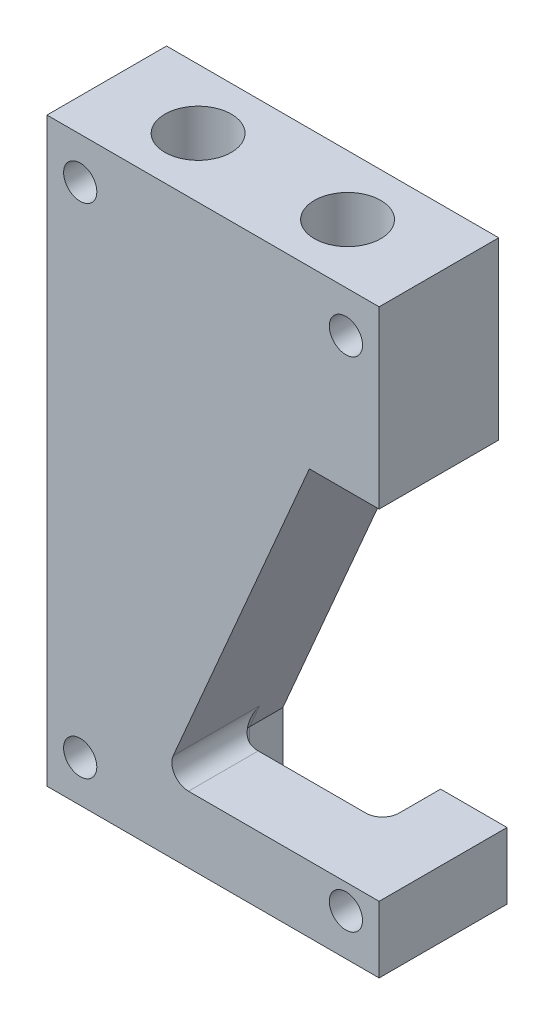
ISO-10303-21;
HEADER;
FILE_DESCRIPTION(('STEP AP214'),'2;1');
FILE_NAME('part.step','',(''),(''),'','','');
FILE_SCHEMA(('AUTOMOTIVE_DESIGN { 1 0 10303 214 1 1 1 1 }'));
ENDSEC;
DATA;
#1=APPLICATION_CONTEXT('core data for automotive mechanical design processes');
#2=APPLICATION_PROTOCOL_DEFINITION('international standard','automotive_design',2000,#1);
#3=PRODUCT_CONTEXT('',#1,'mechanical');
#4=PRODUCT('Part','Part','',(#3));
#5=PRODUCT_RELATED_PRODUCT_CATEGORY('part','',(#4));
#6=PRODUCT_DEFINITION_FORMATION('','',#4);
#7=PRODUCT_DEFINITION_CONTEXT('part definition',#1,'design');
#8=PRODUCT_DEFINITION('design','',#6,#7);
#9=PRODUCT_DEFINITION_SHAPE('','',#8);
#10=(LENGTH_UNIT() NAMED_UNIT(*) SI_UNIT(.MILLI.,.METRE.));
#11=(NAMED_UNIT(*) PLANE_ANGLE_UNIT() SI_UNIT($,.RADIAN.));
#12=(NAMED_UNIT(*) SI_UNIT($,.STERADIAN.) SOLID_ANGLE_UNIT());
#13=UNCERTAINTY_MEASURE_WITH_UNIT(LENGTH_MEASURE(1.E-05),#10,'distance_accuracy_value','');
#14=(GEOMETRIC_REPRESENTATION_CONTEXT(3) GLOBAL_UNCERTAINTY_ASSIGNED_CONTEXT((#13)) GLOBAL_UNIT_ASSIGNED_CONTEXT((#10,
#11,#12)) REPRESENTATION_CONTEXT('',''));
#15=CARTESIAN_POINT('',(0.,0.,0.));
#16=DIRECTION('',(0.,0.,1.));
#17=DIRECTION('',(1.,0.,0.));
#18=AXIS2_PLACEMENT_3D('',#15,#16,#17);
#19=CARTESIAN_POINT('',(10.,4.,-0.600000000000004));
#20=DIRECTION('',(0.,0.,1.));
#21=DIRECTION('',(1.,0.,0.));
#22=AXIS2_PLACEMENT_3D('',#19,#20,#21);
#23=PLANE('',#22);
#24=DIRECTION('',(-1.,0.,0.));
#25=VECTOR('',#24,1.);
#26=CARTESIAN_POINT('',(10.,4.,-0.600000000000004));
#27=LINE('',#26,#25);
#28=CARTESIAN_POINT('',(5.,4.,-0.600000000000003));
#29=VERTEX_POINT('',#28);
#30=CARTESIAN_POINT('',(-1.48102543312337,4.,-0.600000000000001));
#31=VERTEX_POINT('',#30);
#32=EDGE_CURVE('E207',#29,#31,#27,.T.);
#33=ORIENTED_EDGE('',*,*,#32,.F.);
#34=DIRECTION('',(0.,1.,0.));
#35=VECTOR('',#34,1.);
#36=CARTESIAN_POINT('',(5.,0.,-0.600000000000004));
#37=LINE('',#36,#35);
#38=CARTESIAN_POINT('',(5.,0.,-0.600000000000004));
#39=VERTEX_POINT('',#38);
#40=EDGE_CURVE('E61',#29,#39,#37,.F.);
#41=ORIENTED_EDGE('',*,*,#40,.T.);
#42=DIRECTION('',(-1.,0.,0.));
#43=VECTOR('',#42,1.);
#44=CARTESIAN_POINT('',(10.,0.,-0.600000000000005));
#45=LINE('',#44,#43);
#46=CARTESIAN_POINT('',(-2.,0.,-0.600000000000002));
#47=VERTEX_POINT('',#46);
#48=EDGE_CURVE('E210',#39,#47,#45,.T.);
#49=ORIENTED_EDGE('',*,*,#48,.T.);
#50=DIRECTION('',(0.,1.,0.));
#51=VECTOR('',#50,1.);
#52=CARTESIAN_POINT('',(-2.,4.,-0.600000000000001));
#53=LINE('',#52,#51);
#54=CARTESIAN_POINT('',(-2.,3.79397387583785,-0.600000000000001));
#55=VERTEX_POINT('',#54);
#56=EDGE_CURVE('E344',#47,#55,#53,.T.);
#57=ORIENTED_EDGE('',*,*,#56,.T.);
#58=DIRECTION('',(-0.395274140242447,-0.918563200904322,0.));
#59=VECTOR('',#58,1.);
#60=CARTESIAN_POINT('',(-1.48102543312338,5.,-0.600000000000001));
#61=LINE('',#60,#59);
#62=CARTESIAN_POINT('',(-1.87629957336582,4.08143679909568,-0.600000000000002));
#63=VERTEX_POINT('',#62);
#64=EDGE_CURVE('E347',#55,#63,#61,.F.);
#65=ORIENTED_EDGE('',*,*,#64,.T.);
#66=CARTESIAN_POINT('',(-1.48102543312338,5.,-0.600000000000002));
#67=DIRECTION('',(0.,0.,1.));
#68=DIRECTION('',(1.,0.,0.));
#69=AXIS2_PLACEMENT_3D('',#66,#67,#68);
#70=CIRCLE('',#69,1.);
#71=EDGE_CURVE('E336',#63,#31,#70,.T.);
#72=ORIENTED_EDGE('',*,*,#71,.T.);
#73=EDGE_LOOP('',(#33,#41,#49,#57,#65,#72));
#74=FACE_BOUND('',#73,.T.);
#75=ADVANCED_FACE('F45',(#74),#23,.F.);
#76=CARTESIAN_POINT('',(-3.,0.,-3.6));
#77=DIRECTION('',(-1.,0.,0.));
#78=DIRECTION('',(0.,0.,1.));
#79=AXIS2_PLACEMENT_3D('',#76,#77,#78);
#80=PLANE('',#79);
#81=DIRECTION('',(0.,0.,1.));
#82=VECTOR('',#81,1.);
#83=CARTESIAN_POINT('',(-3.,4.,-3.6));
#84=LINE('',#83,#82);
#85=CARTESIAN_POINT('',(-3.,4.,-3.6));
#86=VERTEX_POINT('',#85);
#87=CARTESIAN_POINT('',(-3.,4.,-1.6));
#88=VERTEX_POINT('',#87);
#89=EDGE_CURVE('E242',#86,#88,#84,.T.);
#90=ORIENTED_EDGE('',*,*,#89,.T.);
#91=DIRECTION('',(0.,1.,0.));
#92=VECTOR('',#91,1.);
#93=CARTESIAN_POINT('',(-3.,0.,-1.6));
#94=LINE('',#93,#92);
#95=CARTESIAN_POINT('',(-3.,0.,-1.6));
#96=VERTEX_POINT('',#95);
#97=EDGE_CURVE('E350',#88,#96,#94,.F.);
#98=ORIENTED_EDGE('',*,*,#97,.T.);
#99=DIRECTION('',(0.,0.,1.));
#100=VECTOR('',#99,1.);
#101=CARTESIAN_POINT('',(-3.,0.,-3.6));
#102=LINE('',#101,#100);
#103=CARTESIAN_POINT('',(-3.,0.,-3.6));
#104=VERTEX_POINT('',#103);
#105=EDGE_CURVE('E238',#104,#96,#102,.T.);
#106=ORIENTED_EDGE('',*,*,#105,.F.);
#107=DIRECTION('',(0.,-1.,0.));
#108=VECTOR('',#107,1.);
#109=CARTESIAN_POINT('',(-3.,0.,-3.6));
#110=LINE('',#109,#108);
#111=EDGE_CURVE('E223',#86,#104,#110,.T.);
#112=ORIENTED_EDGE('',*,*,#111,.F.);
#113=EDGE_LOOP('',(#90,#98,#106,#112));
#114=FACE_BOUND('',#113,.T.);
#115=ADVANCED_FACE('F395',(#114),#80,.F.);
#116=CARTESIAN_POINT('',(-10.,35.,-3.6));
#117=DIRECTION('',(1.,0.,0.));
#118=DIRECTION('',(0.,0.,-1.));
#119=AXIS2_PLACEMENT_3D('',#116,#117,#118);
#120=PLANE('',#119);
#121=DIRECTION('',(0.,0.,1.));
#122=VECTOR('',#121,1.);
#123=CARTESIAN_POINT('',(-10.,0.,-3.6));
#124=LINE('',#123,#122);
#125=CARTESIAN_POINT('',(-10.,0.,-3.6));
#126=VERTEX_POINT('',#125);
#127=CARTESIAN_POINT('',(-10.,0.,3.6));
#128=VERTEX_POINT('',#127);
#129=EDGE_CURVE('E276',#126,#128,#124,.T.);
#130=ORIENTED_EDGE('',*,*,#129,.T.);
#131=DIRECTION('',(0.,-1.,0.));
#132=VECTOR('',#131,1.);
#133=CARTESIAN_POINT('',(-10.,35.,3.6));
#134=LINE('',#133,#132);
#135=CARTESIAN_POINT('',(-10.,35.,3.6));
#136=VERTEX_POINT('',#135);
#137=EDGE_CURVE('E322',#136,#128,#134,.T.);
#138=ORIENTED_EDGE('',*,*,#137,.F.);
#139=DIRECTION('',(0.,0.,1.));
#140=VECTOR('',#139,1.);
#141=CARTESIAN_POINT('',(-10.,35.,-3.6));
#142=LINE('',#141,#140);
#143=CARTESIAN_POINT('',(-10.,35.,-3.6));
#144=VERTEX_POINT('',#143);
#145=EDGE_CURVE('E288',#144,#136,#142,.T.);
#146=ORIENTED_EDGE('',*,*,#145,.F.);
#147=DIRECTION('',(0.,-1.,0.));
#148=VECTOR('',#147,1.);
#149=CARTESIAN_POINT('',(-10.,35.,-3.6));
#150=LINE('',#149,#148);
#151=EDGE_CURVE('E302',#144,#126,#150,.T.);
#152=ORIENTED_EDGE('',*,*,#151,.T.);
#153=EDGE_LOOP('',(#130,#138,#146,#152));
#154=FACE_BOUND('',#153,.T.);
#155=ADVANCED_FACE('F385',(#154),#120,.F.);
#156=CARTESIAN_POINT('',(-10.,35.,3.6));
#157=DIRECTION('',(0.,0.,-1.));
#158=DIRECTION('',(-1.,0.,0.));
#159=AXIS2_PLACEMENT_3D('',#156,#157,#158);
#160=PLANE('',#159);
#161=CARTESIAN_POINT('',(8.,2.5,3.6));
#162=DIRECTION('',(0.,0.,1.));
#163=DIRECTION('',(1.,0.,0.));
#164=AXIS2_PLACEMENT_3D('',#161,#162,#163);
#165=CIRCLE('',#164,1.);
#166=CARTESIAN_POINT('',(9.,2.5,3.6));
#167=VERTEX_POINT('',#166);
#168=EDGE_CURVE('E186',#167,#167,#165,.T.);
#169=ORIENTED_EDGE('',*,*,#168,.F.);
#170=EDGE_LOOP('',(#169));
#171=FACE_BOUND('',#170,.T.);
#172=CARTESIAN_POINT('',(8.,32.5,3.6));
#173=DIRECTION('',(0.,0.,1.));
#174=DIRECTION('',(1.,0.,0.));
#175=AXIS2_PLACEMENT_3D('',#172,#173,#174);
#176=CIRCLE('',#175,1.);
#177=CARTESIAN_POINT('',(9.,32.5,3.6));
#178=VERTEX_POINT('',#177);
#179=EDGE_CURVE('E248',#178,#178,#176,.T.);
#180=ORIENTED_EDGE('',*,*,#179,.F.);
#181=EDGE_LOOP('',(#180));
#182=FACE_BOUND('',#181,.T.);
#183=CARTESIAN_POINT('',(-8.,2.5,3.6));
#184=DIRECTION('',(0.,0.,1.));
#185=DIRECTION('',(1.,0.,0.));
#186=AXIS2_PLACEMENT_3D('',#183,#184,#185);
#187=CIRCLE('',#186,1.);
#188=CARTESIAN_POINT('',(-7.,2.5,3.6));
#189=VERTEX_POINT('',#188);
#190=EDGE_CURVE('E257',#189,#189,#187,.T.);
#191=ORIENTED_EDGE('',*,*,#190,.F.);
#192=EDGE_LOOP('',(#191));
#193=FACE_BOUND('',#192,.T.);
#194=CARTESIAN_POINT('',(-8.,32.5,3.6));
#195=DIRECTION('',(0.,0.,1.));
#196=DIRECTION('',(1.,0.,0.));
#197=AXIS2_PLACEMENT_3D('',#194,#195,#196);
#198=CIRCLE('',#197,1.);
#199=CARTESIAN_POINT('',(-7.,32.5,3.6));
#200=VERTEX_POINT('',#199);
#201=EDGE_CURVE('E252',#200,#200,#198,.T.);
#202=ORIENTED_EDGE('',*,*,#201,.F.);
#203=EDGE_LOOP('',(#202));
#204=FACE_BOUND('',#203,.T.);
#205=DIRECTION('',(-0.395274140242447,-0.918563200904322,0.));
#206=VECTOR('',#205,1.);
#207=CARTESIAN_POINT('',(-3.,4.,3.6));
#208=LINE('',#207,#206);
#209=CARTESIAN_POINT('',(5.8,24.45,3.6));
#210=VERTEX_POINT('',#209);
#211=CARTESIAN_POINT('',(-2.3995886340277,5.39527414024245,3.6));
#212=VERTEX_POINT('',#211);
#213=EDGE_CURVE('E219',#210,#212,#208,.T.);
#214=ORIENTED_EDGE('',*,*,#213,.F.);
#215=DIRECTION('',(-1.,0.,0.));
#216=VECTOR('',#215,1.);
#217=CARTESIAN_POINT('',(5.8,24.45,3.6));
#218=LINE('',#217,#216);
#219=CARTESIAN_POINT('',(10.,24.45,3.6));
#220=VERTEX_POINT('',#219);
#221=EDGE_CURVE('E213',#220,#210,#218,.T.);
#222=ORIENTED_EDGE('',*,*,#221,.F.);
#223=DIRECTION('',(0.,-1.,0.));
#224=VECTOR('',#223,1.);
#225=CARTESIAN_POINT('',(10.,35.,3.6));
#226=LINE('',#225,#224);
#227=CARTESIAN_POINT('',(10.,35.,3.6));
#228=VERTEX_POINT('',#227);
#229=EDGE_CURVE('E318',#228,#220,#226,.T.);
#230=ORIENTED_EDGE('',*,*,#229,.F.);
#231=DIRECTION('',(1.,0.,0.));
#232=VECTOR('',#231,1.);
#233=CARTESIAN_POINT('',(-10.,35.,3.6));
#234=LINE('',#233,#232);
#235=EDGE_CURVE('E292',#136,#228,#234,.T.);
#236=ORIENTED_EDGE('',*,*,#235,.F.);
#237=ORIENTED_EDGE('',*,*,#137,.T.);
#238=DIRECTION('',(1.,0.,0.));
#239=VECTOR('',#238,1.);
#240=CARTESIAN_POINT('',(-10.,0.,3.6));
#241=LINE('',#240,#239);
#242=CARTESIAN_POINT('',(10.,0.,3.6));
#243=VERTEX_POINT('',#242);
#244=EDGE_CURVE('E306',#128,#243,#241,.T.);
#245=ORIENTED_EDGE('',*,*,#244,.T.);
#246=DIRECTION('',(0.,-1.,0.));
#247=VECTOR('',#246,1.);
#248=CARTESIAN_POINT('',(10.,4.,3.6));
#249=LINE('',#248,#247);
#250=CARTESIAN_POINT('',(10.,4.,3.6));
#251=VERTEX_POINT('',#250);
#252=EDGE_CURVE('E161',#251,#243,#249,.T.);
#253=ORIENTED_EDGE('',*,*,#252,.F.);
#254=DIRECTION('',(-1.,0.,0.));
#255=VECTOR('',#254,1.);
#256=CARTESIAN_POINT('',(10.,4.,3.6));
#257=LINE('',#256,#255);
#258=CARTESIAN_POINT('',(-1.48102543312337,4.,3.6));
#259=VERTEX_POINT('',#258);
#260=EDGE_CURVE('E203',#251,#259,#257,.T.);
#261=ORIENTED_EDGE('',*,*,#260,.T.);
#262=CARTESIAN_POINT('',(-1.48102543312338,5.,3.6));
#263=DIRECTION('',(0.,0.,-1.));
#264=DIRECTION('',(-1.,0.,0.));
#265=AXIS2_PLACEMENT_3D('',#262,#263,#264);
#266=CIRCLE('',#265,1.);
#267=EDGE_CURVE('E333',#259,#212,#266,.T.);
#268=ORIENTED_EDGE('',*,*,#267,.T.);
#269=EDGE_LOOP('',(#214,#222,#230,#236,#237,#245,#253,#261,#268));
#270=FACE_BOUND('',#269,.T.);
#271=ADVANCED_FACE('F381',(#171,#182,#193,#204,#270),#160,.F.);
#272=CARTESIAN_POINT('',(10.,35.,-3.6));
#273=DIRECTION('',(-1.,0.,0.));
#274=DIRECTION('',(0.,0.,1.));
#275=AXIS2_PLACEMENT_3D('',#272,#273,#274);
#276=PLANE('',#275);
#277=ORIENTED_EDGE('',*,*,#229,.T.);
#278=DIRECTION('',(0.,0.,1.));
#279=VECTOR('',#278,1.);
#280=CARTESIAN_POINT('',(10.,24.45,-3.6));
#281=LINE('',#280,#279);
#282=CARTESIAN_POINT('',(10.,24.45,-3.6));
#283=VERTEX_POINT('',#282);
#284=EDGE_CURVE('E234',#283,#220,#281,.T.);
#285=ORIENTED_EDGE('',*,*,#284,.F.);
#286=DIRECTION('',(0.,-1.,0.));
#287=VECTOR('',#286,1.);
#288=CARTESIAN_POINT('',(10.,35.,-3.6));
#289=LINE('',#288,#287);
#290=CARTESIAN_POINT('',(10.,35.,-3.6));
#291=VERTEX_POINT('',#290);
#292=EDGE_CURVE('E314',#291,#283,#289,.T.);
#293=ORIENTED_EDGE('',*,*,#292,.F.);
#294=DIRECTION('',(0.,0.,-1.));
#295=VECTOR('',#294,1.);
#296=CARTESIAN_POINT('',(10.,35.,-3.6));
#297=LINE('',#296,#295);
#298=EDGE_CURVE('E296',#228,#291,#297,.T.);
#299=ORIENTED_EDGE('',*,*,#298,.F.);
#300=EDGE_LOOP('',(#277,#285,#293,#299));
#301=FACE_BOUND('',#300,.T.);
#302=ADVANCED_FACE('F470',(#301),#276,.F.);
#303=CARTESIAN_POINT('',(-10.,35.,-3.6));
#304=DIRECTION('',(0.,0.,1.));
#305=DIRECTION('',(1.,0.,0.));
#306=AXIS2_PLACEMENT_3D('',#303,#304,#305);
#307=PLANE('',#306);
#308=ORIENTED_EDGE('',*,*,#292,.T.);
#309=DIRECTION('',(-1.,0.,0.));
#310=VECTOR('',#309,1.);
#311=CARTESIAN_POINT('',(5.8,24.45,-3.6));
#312=LINE('',#311,#310);
#313=CARTESIAN_POINT('',(5.8,24.45,-3.6));
#314=VERTEX_POINT('',#313);
#315=EDGE_CURVE('E214',#283,#314,#312,.T.);
#316=ORIENTED_EDGE('',*,*,#315,.T.);
#317=DIRECTION('',(-0.395274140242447,-0.918563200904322,0.));
#318=VECTOR('',#317,1.);
#319=CARTESIAN_POINT('',(-3.,4.,-3.6));
#320=LINE('',#319,#318);
#321=EDGE_CURVE('E218',#314,#86,#320,.T.);
#322=ORIENTED_EDGE('',*,*,#321,.T.);
#323=ORIENTED_EDGE('',*,*,#111,.T.);
#324=DIRECTION('',(-1.,0.,0.));
#325=VECTOR('',#324,1.);
#326=CARTESIAN_POINT('',(-10.,0.,-3.6));
#327=LINE('',#326,#325);
#328=EDGE_CURVE('E293',#104,#126,#327,.T.);
#329=ORIENTED_EDGE('',*,*,#328,.T.);
#330=ORIENTED_EDGE('',*,*,#151,.F.);
#331=DIRECTION('',(-1.,0.,0.));
#332=VECTOR('',#331,1.);
#333=CARTESIAN_POINT('',(-10.,35.,-3.6));
#334=LINE('',#333,#332);
#335=EDGE_CURVE('E299',#291,#144,#334,.T.);
#336=ORIENTED_EDGE('',*,*,#335,.F.);
#337=EDGE_LOOP('',(#308,#316,#322,#323,#329,#330,#336));
#338=FACE_BOUND('',#337,.T.);
#339=CARTESIAN_POINT('',(8.,32.5,-3.6));
#340=DIRECTION('',(0.,0.,1.));
#341=DIRECTION('',(1.,0.,0.));
#342=AXIS2_PLACEMENT_3D('',#339,#340,#341);
#343=CIRCLE('',#342,1.);
#344=CARTESIAN_POINT('',(9.,32.5,-3.6));
#345=VERTEX_POINT('',#344);
#346=EDGE_CURVE('E253',#345,#345,#343,.T.);
#347=ORIENTED_EDGE('',*,*,#346,.T.);
#348=EDGE_LOOP('',(#347));
#349=FACE_BOUND('',#348,.T.);
#350=CARTESIAN_POINT('',(-8.,2.5,-3.6));
#351=DIRECTION('',(0.,0.,1.));
#352=DIRECTION('',(1.,0.,0.));
#353=AXIS2_PLACEMENT_3D('',#350,#351,#352);
#354=CIRCLE('',#353,1.);
#355=CARTESIAN_POINT('',(-7.,2.5,-3.6));
#356=VERTEX_POINT('',#355);
#357=EDGE_CURVE('E237',#356,#356,#354,.T.);
#358=ORIENTED_EDGE('',*,*,#357,.T.);
#359=EDGE_LOOP('',(#358));
#360=FACE_BOUND('',#359,.T.);
#361=CARTESIAN_POINT('',(-8.,32.5,-3.6));
#362=DIRECTION('',(0.,0.,1.));
#363=DIRECTION('',(1.,0.,0.));
#364=AXIS2_PLACEMENT_3D('',#361,#362,#363);
#365=CIRCLE('',#364,1.);
#366=CARTESIAN_POINT('',(-7.,32.5,-3.6));
#367=VERTEX_POINT('',#366);
#368=EDGE_CURVE('E264',#367,#367,#365,.T.);
#369=ORIENTED_EDGE('',*,*,#368,.T.);
#370=EDGE_LOOP('',(#369));
#371=FACE_BOUND('',#370,.T.);
#372=ADVANCED_FACE('F390',(#338,#349,#360,#371),#307,.F.);
#373=CARTESIAN_POINT('',(0.,35.,0.));
#374=DIRECTION('',(0.,1.,0.));
#375=DIRECTION('',(0.,0.,1.));
#376=AXIS2_PLACEMENT_3D('',#373,#374,#375);
#377=PLANE('',#376);
#378=CARTESIAN_POINT('',(-4.5,35.,0.));
#379=DIRECTION('',(0.,1.,0.));
#380=DIRECTION('',(0.,0.,1.));
#381=AXIS2_PLACEMENT_3D('',#378,#379,#380);
#382=CIRCLE('',#381,2.);
#383=CARTESIAN_POINT('',(-4.5,35.,2.));
#384=VERTEX_POINT('',#383);
#385=EDGE_CURVE('E277',#384,#384,#382,.T.);
#386=ORIENTED_EDGE('',*,*,#385,.F.);
#387=EDGE_LOOP('',(#386));
#388=FACE_BOUND('',#387,.T.);
#389=CARTESIAN_POINT('',(4.5,35.,0.));
#390=DIRECTION('',(0.,1.,0.));
#391=DIRECTION('',(0.,0.,1.));
#392=AXIS2_PLACEMENT_3D('',#389,#390,#391);
#393=CIRCLE('',#392,2.);
#394=CARTESIAN_POINT('',(4.5,35.,2.));
#395=VERTEX_POINT('',#394);
#396=EDGE_CURVE('E281',#395,#395,#393,.T.);
#397=ORIENTED_EDGE('',*,*,#396,.F.);
#398=EDGE_LOOP('',(#397));
#399=FACE_BOUND('',#398,.T.);
#400=ORIENTED_EDGE('',*,*,#145,.T.);
#401=ORIENTED_EDGE('',*,*,#235,.T.);
#402=ORIENTED_EDGE('',*,*,#298,.T.);
#403=ORIENTED_EDGE('',*,*,#335,.T.);
#404=EDGE_LOOP('',(#400,#401,#402,#403));
#405=FACE_BOUND('',#404,.T.);
#406=ADVANCED_FACE('F463',(#388,#399,#405),#377,.T.);
#407=CARTESIAN_POINT('',(0.,0.,0.));
#408=DIRECTION('',(0.,1.,0.));
#409=DIRECTION('',(0.,0.,1.));
#410=AXIS2_PLACEMENT_3D('',#407,#408,#409);
#411=PLANE('',#410);
#412=ORIENTED_EDGE('',*,*,#328,.F.);
#413=ORIENTED_EDGE('',*,*,#105,.T.);
#414=CARTESIAN_POINT('',(-2.,0.,-1.6));
#415=DIRECTION('',(0.,1.,0.));
#416=DIRECTION('',(0.,0.,1.));
#417=AXIS2_PLACEMENT_3D('',#414,#415,#416);
#418=CIRCLE('',#417,1.);
#419=EDGE_CURVE('E357',#96,#47,#418,.T.);
#420=ORIENTED_EDGE('',*,*,#419,.T.);
#421=ORIENTED_EDGE('',*,*,#48,.F.);
#422=CARTESIAN_POINT('',(5.,0.,-1.6));
#423=DIRECTION('',(0.,1.,0.));
#424=DIRECTION('',(0.,0.,1.));
#425=AXIS2_PLACEMENT_3D('',#422,#423,#424);
#426=CIRCLE('',#425,1.);
#427=CARTESIAN_POINT('',(6.,0.,-1.6));
#428=VERTEX_POINT('',#427);
#429=EDGE_CURVE('E11',#39,#428,#426,.T.);
#430=ORIENTED_EDGE('',*,*,#429,.T.);
#431=DIRECTION('',(0.,0.,1.));
#432=VECTOR('',#431,1.);
#433=CARTESIAN_POINT('',(6.,0.,-4.1));
#434=LINE('',#433,#432);
#435=CARTESIAN_POINT('',(6.,0.,-4.1));
#436=VERTEX_POINT('',#435);
#437=EDGE_CURVE('E171',#436,#428,#434,.T.);
#438=ORIENTED_EDGE('',*,*,#437,.F.);
#439=DIRECTION('',(-1.,0.,0.));
#440=VECTOR('',#439,1.);
#441=CARTESIAN_POINT('',(10.,0.,-4.1));
#442=LINE('',#441,#440);
#443=CARTESIAN_POINT('',(10.,0.,-4.1));
#444=VERTEX_POINT('',#443);
#445=EDGE_CURVE('E167',#444,#436,#442,.T.);
#446=ORIENTED_EDGE('',*,*,#445,.F.);
#447=DIRECTION('',(0.,0.,-1.));
#448=VECTOR('',#447,1.);
#449=CARTESIAN_POINT('',(10.,0.,3.6));
#450=LINE('',#449,#448);
#451=EDGE_CURVE('E155',#243,#444,#450,.T.);
#452=ORIENTED_EDGE('',*,*,#451,.F.);
#453=ORIENTED_EDGE('',*,*,#244,.F.);
#454=ORIENTED_EDGE('',*,*,#129,.F.);
#455=EDGE_LOOP('',(#412,#413,#420,#421,#430,#438,#446,#452,#453,#454));
#456=FACE_BOUND('',#455,.T.);
#457=ADVANCED_FACE('F169',(#456),#411,.F.);
#458=CARTESIAN_POINT('',(4.5,28.,0.));
#459=DIRECTION('',(0.,1.,0.));
#460=DIRECTION('',(0.,0.,1.));
#461=AXIS2_PLACEMENT_3D('',#458,#459,#460);
#462=CYLINDRICAL_SURFACE('',#461,2.);
#463=CARTESIAN_POINT('',(4.5,28.,0.));
#464=DIRECTION('',(0.,1.,0.));
#465=DIRECTION('',(0.,0.,1.));
#466=AXIS2_PLACEMENT_3D('',#463,#464,#465);
#467=CIRCLE('',#466,2.);
#468=CARTESIAN_POINT('',(4.5,28.,2.));
#469=VERTEX_POINT('',#468);
#470=EDGE_CURVE('E268',#469,#469,#467,.T.);
#471=ORIENTED_EDGE('',*,*,#470,.F.);
#472=EDGE_LOOP('',(#471));
#473=FACE_BOUND('',#472,.T.);
#474=ORIENTED_EDGE('',*,*,#396,.T.);
#475=EDGE_LOOP('',(#474));
#476=FACE_BOUND('',#475,.T.);
#477=ADVANCED_FACE('F456',(#473,#476),#462,.F.);
#478=CARTESIAN_POINT('',(4.5,28.,0.));
#479=DIRECTION('',(0.,1.,0.));
#480=DIRECTION('',(0.,0.,1.));
#481=AXIS2_PLACEMENT_3D('',#478,#479,#480);
#482=PLANE('',#481);
#483=ORIENTED_EDGE('',*,*,#470,.T.);
#484=EDGE_LOOP('',(#483));
#485=FACE_BOUND('',#484,.T.);
#486=ADVANCED_FACE('F454',(#485),#482,.T.);
#487=CARTESIAN_POINT('',(-4.5,28.,0.));
#488=DIRECTION('',(0.,1.,0.));
#489=DIRECTION('',(0.,0.,1.));
#490=AXIS2_PLACEMENT_3D('',#487,#488,#489);
#491=CYLINDRICAL_SURFACE('',#490,2.);
#492=CARTESIAN_POINT('',(-4.5,28.,0.));
#493=DIRECTION('',(0.,1.,0.));
#494=DIRECTION('',(0.,0.,1.));
#495=AXIS2_PLACEMENT_3D('',#492,#493,#494);
#496=CIRCLE('',#495,2.);
#497=CARTESIAN_POINT('',(-4.5,28.,2.));
#498=VERTEX_POINT('',#497);
#499=EDGE_CURVE('E272',#498,#498,#496,.T.);
#500=ORIENTED_EDGE('',*,*,#499,.F.);
#501=EDGE_LOOP('',(#500));
#502=FACE_BOUND('',#501,.T.);
#503=ORIENTED_EDGE('',*,*,#385,.T.);
#504=EDGE_LOOP('',(#503));
#505=FACE_BOUND('',#504,.T.);
#506=ADVANCED_FACE('F450',(#502,#505),#491,.F.);
#507=CARTESIAN_POINT('',(-4.5,28.,0.));
#508=DIRECTION('',(0.,1.,0.));
#509=DIRECTION('',(0.,0.,1.));
#510=AXIS2_PLACEMENT_3D('',#507,#508,#509);
#511=PLANE('',#510);
#512=ORIENTED_EDGE('',*,*,#499,.T.);
#513=EDGE_LOOP('',(#512));
#514=FACE_BOUND('',#513,.T.);
#515=ADVANCED_FACE('F446',(#514),#511,.T.);
#516=CARTESIAN_POINT('',(-8.,32.5,-3.6));
#517=DIRECTION('',(0.,0.,1.));
#518=DIRECTION('',(1.,0.,0.));
#519=AXIS2_PLACEMENT_3D('',#516,#517,#518);
#520=CYLINDRICAL_SURFACE('',#519,1.);
#521=ORIENTED_EDGE('',*,*,#368,.F.);
#522=EDGE_LOOP('',(#521));
#523=FACE_BOUND('',#522,.T.);
#524=ORIENTED_EDGE('',*,*,#201,.T.);
#525=EDGE_LOOP('',(#524));
#526=FACE_BOUND('',#525,.T.);
#527=ADVANCED_FACE('F442',(#523,#526),#520,.F.);
#528=CARTESIAN_POINT('',(-8.,2.5,-3.6));
#529=DIRECTION('',(0.,0.,1.));
#530=DIRECTION('',(1.,0.,0.));
#531=AXIS2_PLACEMENT_3D('',#528,#529,#530);
#532=CYLINDRICAL_SURFACE('',#531,1.);
#533=ORIENTED_EDGE('',*,*,#357,.F.);
#534=EDGE_LOOP('',(#533));
#535=FACE_BOUND('',#534,.T.);
#536=ORIENTED_EDGE('',*,*,#190,.T.);
#537=EDGE_LOOP('',(#536));
#538=FACE_BOUND('',#537,.T.);
#539=ADVANCED_FACE('F438',(#535,#538),#532,.F.);
#540=CARTESIAN_POINT('',(8.,32.5,-3.6));
#541=DIRECTION('',(0.,0.,1.));
#542=DIRECTION('',(1.,0.,0.));
#543=AXIS2_PLACEMENT_3D('',#540,#541,#542);
#544=CYLINDRICAL_SURFACE('',#543,1.);
#545=ORIENTED_EDGE('',*,*,#346,.F.);
#546=EDGE_LOOP('',(#545));
#547=FACE_BOUND('',#546,.T.);
#548=ORIENTED_EDGE('',*,*,#179,.T.);
#549=EDGE_LOOP('',(#548));
#550=FACE_BOUND('',#549,.T.);
#551=ADVANCED_FACE('F434',(#547,#550),#544,.F.);
#552=CARTESIAN_POINT('',(5.8,24.45,-3.6));
#553=DIRECTION('',(0.,1.,0.));
#554=DIRECTION('',(0.,0.,1.));
#555=AXIS2_PLACEMENT_3D('',#552,#553,#554);
#556=PLANE('',#555);
#557=ORIENTED_EDGE('',*,*,#221,.T.);
#558=DIRECTION('',(0.,0.,1.));
#559=VECTOR('',#558,1.);
#560=CARTESIAN_POINT('',(5.8,24.45,-3.6));
#561=LINE('',#560,#559);
#562=EDGE_CURVE('E227',#314,#210,#561,.T.);
#563=ORIENTED_EDGE('',*,*,#562,.F.);
#564=ORIENTED_EDGE('',*,*,#315,.F.);
#565=ORIENTED_EDGE('',*,*,#284,.T.);
#566=EDGE_LOOP('',(#557,#563,#564,#565));
#567=FACE_BOUND('',#566,.T.);
#568=ADVANCED_FACE('F430',(#567),#556,.F.);
#569=CARTESIAN_POINT('',(-3.,4.,-3.6));
#570=DIRECTION('',(-0.918563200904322,0.395274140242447,0.));
#571=DIRECTION('',(-0.395274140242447,-0.918563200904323,0.));
#572=AXIS2_PLACEMENT_3D('',#569,#570,#571);
#573=PLANE('',#572);
#574=DIRECTION('',(0.,0.,1.));
#575=VECTOR('',#574,1.);
#576=CARTESIAN_POINT('',(-2.3995886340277,5.39527414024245,-0.600000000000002));
#577=LINE('',#576,#575);
#578=CARTESIAN_POINT('',(-2.3995886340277,5.39527414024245,-1.6));
#579=VERTEX_POINT('',#578);
#580=EDGE_CURVE('E330',#212,#579,#577,.F.);
#581=ORIENTED_EDGE('',*,*,#580,.T.);
#582=DIRECTION('',(-0.395274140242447,-0.918563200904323,0.));
#583=VECTOR('',#582,1.);
#584=CARTESIAN_POINT('',(-3.,4.,-1.6));
#585=LINE('',#584,#583);
#586=EDGE_CURVE('E340',#579,#88,#585,.T.);
#587=ORIENTED_EDGE('',*,*,#586,.T.);
#588=ORIENTED_EDGE('',*,*,#89,.F.);
#589=ORIENTED_EDGE('',*,*,#321,.F.);
#590=ORIENTED_EDGE('',*,*,#562,.T.);
#591=ORIENTED_EDGE('',*,*,#213,.T.);
#592=EDGE_LOOP('',(#581,#587,#588,#589,#590,#591));
#593=FACE_BOUND('',#592,.T.);
#594=ADVANCED_FACE('F427',(#593),#573,.F.);
#595=CARTESIAN_POINT('',(10.,4.,3.6));
#596=DIRECTION('',(0.,-1.,0.));
#597=DIRECTION('',(0.,0.,-1.));
#598=AXIS2_PLACEMENT_3D('',#595,#596,#597);
#599=PLANE('',#598);
#600=DIRECTION('',(0.,0.,1.));
#601=VECTOR('',#600,1.);
#602=CARTESIAN_POINT('',(6.,4.,-4.1));
#603=LINE('',#602,#601);
#604=CARTESIAN_POINT('',(6.,4.,-4.1));
#605=VERTEX_POINT('',#604);
#606=CARTESIAN_POINT('',(6.,4.,-1.6));
#607=VERTEX_POINT('',#606);
#608=EDGE_CURVE('E194',#605,#607,#603,.T.);
#609=ORIENTED_EDGE('',*,*,#608,.T.);
#610=CARTESIAN_POINT('',(5.,4.,-1.6));
#611=DIRECTION('',(0.,-1.,0.));
#612=DIRECTION('',(0.,0.,-1.));
#613=AXIS2_PLACEMENT_3D('',#610,#611,#612);
#614=CIRCLE('',#613,1.);
#615=EDGE_CURVE('E54',#607,#29,#614,.T.);
#616=ORIENTED_EDGE('',*,*,#615,.T.);
#617=ORIENTED_EDGE('',*,*,#32,.T.);
#618=DIRECTION('',(0.,0.,1.));
#619=VECTOR('',#618,1.);
#620=CARTESIAN_POINT('',(-1.48102543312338,4.,3.6));
#621=LINE('',#620,#619);
#622=EDGE_CURVE('E326',#31,#259,#621,.T.);
#623=ORIENTED_EDGE('',*,*,#622,.T.);
#624=ORIENTED_EDGE('',*,*,#260,.F.);
#625=DIRECTION('',(0.,0.,1.));
#626=VECTOR('',#625,1.);
#627=CARTESIAN_POINT('',(10.,4.,3.6));
#628=LINE('',#627,#626);
#629=CARTESIAN_POINT('',(10.,4.,-4.1));
#630=VERTEX_POINT('',#629);
#631=EDGE_CURVE('E164',#630,#251,#628,.T.);
#632=ORIENTED_EDGE('',*,*,#631,.F.);
#633=DIRECTION('',(1.,0.,0.));
#634=VECTOR('',#633,1.);
#635=CARTESIAN_POINT('',(10.,4.,-4.1));
#636=LINE('',#635,#634);
#637=EDGE_CURVE('E180',#605,#630,#636,.T.);
#638=ORIENTED_EDGE('',*,*,#637,.F.);
#639=EDGE_LOOP('',(#609,#616,#617,#623,#624,#632,#638));
#640=FACE_BOUND('',#639,.T.);
#641=ADVANCED_FACE('F376',(#640),#599,.F.);
#642=CARTESIAN_POINT('',(10.,0.,0.));
#643=DIRECTION('',(1.,0.,0.));
#644=DIRECTION('',(0.,0.,-1.));
#645=AXIS2_PLACEMENT_3D('',#642,#643,#644);
#646=PLANE('',#645);
#647=ORIENTED_EDGE('',*,*,#252,.T.);
#648=ORIENTED_EDGE('',*,*,#451,.T.);
#649=DIRECTION('',(0.,-1.,0.));
#650=VECTOR('',#649,1.);
#651=CARTESIAN_POINT('',(10.,4.,-4.1));
#652=LINE('',#651,#650);
#653=EDGE_CURVE('E159',#630,#444,#652,.T.);
#654=ORIENTED_EDGE('',*,*,#653,.F.);
#655=ORIENTED_EDGE('',*,*,#631,.T.);
#656=EDGE_LOOP('',(#647,#648,#654,#655));
#657=FACE_BOUND('',#656,.T.);
#658=ADVANCED_FACE('F157',(#657),#646,.T.);
#659=CARTESIAN_POINT('',(6.,4.,-4.1));
#660=DIRECTION('',(1.,0.,0.));
#661=DIRECTION('',(0.,1.,0.));
#662=AXIS2_PLACEMENT_3D('',#659,#660,#661);
#663=PLANE('',#662);
#664=ORIENTED_EDGE('',*,*,#437,.T.);
#665=DIRECTION('',(0.,1.,0.));
#666=VECTOR('',#665,1.);
#667=CARTESIAN_POINT('',(6.,4.,-1.6));
#668=LINE('',#667,#666);
#669=EDGE_CURVE('E361',#428,#607,#668,.T.);
#670=ORIENTED_EDGE('',*,*,#669,.T.);
#671=ORIENTED_EDGE('',*,*,#608,.F.);
#672=DIRECTION('',(0.,1.,0.));
#673=VECTOR('',#672,1.);
#674=CARTESIAN_POINT('',(6.,4.,-4.1));
#675=LINE('',#674,#673);
#676=EDGE_CURVE('E175',#436,#605,#675,.T.);
#677=ORIENTED_EDGE('',*,*,#676,.F.);
#678=EDGE_LOOP('',(#664,#670,#671,#677));
#679=FACE_BOUND('',#678,.T.);
#680=ADVANCED_FACE('F373',(#679),#663,.F.);
#681=CARTESIAN_POINT('',(0.,0.,-4.1));
#682=DIRECTION('',(0.,0.,-1.));
#683=DIRECTION('',(0.,1.,0.));
#684=AXIS2_PLACEMENT_3D('',#681,#682,#683);
#685=PLANE('',#684);
#686=CARTESIAN_POINT('',(8.,2.5,-4.1));
#687=DIRECTION('',(0.,0.,1.));
#688=DIRECTION('',(1.,0.,0.));
#689=AXIS2_PLACEMENT_3D('',#686,#687,#688);
#690=CIRCLE('',#689,1.);
#691=CARTESIAN_POINT('',(9.,2.5,-4.1));
#692=VERTEX_POINT('',#691);
#693=EDGE_CURVE('E182',#692,#692,#690,.T.);
#694=ORIENTED_EDGE('',*,*,#693,.T.);
#695=EDGE_LOOP('',(#694));
#696=FACE_BOUND('',#695,.T.);
#697=ORIENTED_EDGE('',*,*,#653,.T.);
#698=ORIENTED_EDGE('',*,*,#445,.T.);
#699=ORIENTED_EDGE('',*,*,#676,.T.);
#700=ORIENTED_EDGE('',*,*,#637,.T.);
#701=EDGE_LOOP('',(#697,#698,#699,#700));
#702=FACE_BOUND('',#701,.T.);
#703=ADVANCED_FACE('F178',(#696,#702),#685,.T.);
#704=CARTESIAN_POINT('',(8.,2.5,-4.1));
#705=DIRECTION('',(0.,0.,1.));
#706=DIRECTION('',(1.,0.,0.));
#707=AXIS2_PLACEMENT_3D('',#704,#705,#706);
#708=CYLINDRICAL_SURFACE('',#707,1.);
#709=ORIENTED_EDGE('',*,*,#693,.F.);
#710=EDGE_LOOP('',(#709));
#711=FACE_BOUND('',#710,.T.);
#712=ORIENTED_EDGE('',*,*,#168,.T.);
#713=EDGE_LOOP('',(#712));
#714=FACE_BOUND('',#713,.T.);
#715=ADVANCED_FACE('F480',(#711,#714),#708,.F.);
#716=CARTESIAN_POINT('',(-1.48102543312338,5.,3.6));
#717=DIRECTION('',(0.,0.,-1.));
#718=DIRECTION('',(-1.,0.,0.));
#719=AXIS2_PLACEMENT_3D('',#716,#717,#718);
#720=CYLINDRICAL_SURFACE('',#719,1.);
#721=ORIENTED_EDGE('',*,*,#71,.F.);
#722=CARTESIAN_POINT('',(-1.48102543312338,5.,-1.6));
#723=DIRECTION('',(-0.279501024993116,-0.649522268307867,-0.707106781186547));
#724=DIRECTION('',(0.279501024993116,0.649522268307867,-0.707106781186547));
#725=AXIS2_PLACEMENT_3D('',#722,#723,#724);
#726=ELLIPSE('',#725,1.41421356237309,1.);
#727=EDGE_CURVE('E353',#63,#579,#726,.T.);
#728=ORIENTED_EDGE('',*,*,#727,.T.);
#729=ORIENTED_EDGE('',*,*,#580,.F.);
#730=ORIENTED_EDGE('',*,*,#267,.F.);
#731=ORIENTED_EDGE('',*,*,#622,.F.);
#732=EDGE_LOOP('',(#721,#728,#729,#730,#731));
#733=FACE_BOUND('',#732,.T.);
#734=ADVANCED_FACE('F410',(#733),#720,.F.);
#735=CARTESIAN_POINT('',(-2.,4.,-1.6));
#736=DIRECTION('',(0.,-1.,0.));
#737=DIRECTION('',(0.,0.,-1.));
#738=AXIS2_PLACEMENT_3D('',#735,#736,#737);
#739=CYLINDRICAL_SURFACE('',#738,1.);
#740=ORIENTED_EDGE('',*,*,#419,.F.);
#741=ORIENTED_EDGE('',*,*,#97,.F.);
#742=CARTESIAN_POINT('',(-2.,3.79397387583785,-1.6));
#743=DIRECTION('',(0.201788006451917,0.979429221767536,0.));
#744=DIRECTION('',(0.979429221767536,-0.201788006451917,0.));
#745=AXIS2_PLACEMENT_3D('',#742,#743,#744);
#746=ELLIPSE('',#745,1.02100282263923,1.);
#747=EDGE_CURVE('E362',#55,#88,#746,.F.);
#748=ORIENTED_EDGE('',*,*,#747,.F.);
#749=ORIENTED_EDGE('',*,*,#56,.F.);
#750=EDGE_LOOP('',(#740,#741,#748,#749));
#751=FACE_BOUND('',#750,.T.);
#752=ADVANCED_FACE('F400',(#751),#739,.F.);
#753=CARTESIAN_POINT('',(-2.08143679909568,3.60472585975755,-1.6));
#754=DIRECTION('',(0.395274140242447,0.918563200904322,0.));
#755=DIRECTION('',(-0.918563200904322,0.395274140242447,0.));
#756=AXIS2_PLACEMENT_3D('',#753,#754,#755);
#757=CYLINDRICAL_SURFACE('',#756,1.);
#758=ORIENTED_EDGE('',*,*,#727,.F.);
#759=ORIENTED_EDGE('',*,*,#64,.F.);
#760=ORIENTED_EDGE('',*,*,#747,.T.);
#761=ORIENTED_EDGE('',*,*,#586,.F.);
#762=EDGE_LOOP('',(#758,#759,#760,#761));
#763=FACE_BOUND('',#762,.T.);
#764=ADVANCED_FACE('F406',(#763),#757,.F.);
#765=CARTESIAN_POINT('',(5.,4.,-1.6));
#766=DIRECTION('',(0.,-1.,0.));
#767=DIRECTION('',(1.,0.,0.));
#768=AXIS2_PLACEMENT_3D('',#765,#766,#767);
#769=CYLINDRICAL_SURFACE('',#768,1.);
#770=ORIENTED_EDGE('',*,*,#429,.F.);
#771=ORIENTED_EDGE('',*,*,#40,.F.);
#772=ORIENTED_EDGE('',*,*,#615,.F.);
#773=ORIENTED_EDGE('',*,*,#669,.F.);
#774=EDGE_LOOP('',(#770,#771,#772,#773));
#775=FACE_BOUND('',#774,.T.);
#776=ADVANCED_FACE('F47',(#775),#769,.F.);
#777=CLOSED_SHELL('',(#75,#115,#155,#271,#302,#372,#406,#457,#477,#486,#506,#515,#527,#539,#551,
#568,#594,#641,#658,#680,#703,#715,#734,#752,#764,#776));
#778=MANIFOLD_SOLID_BREP('B2',#777);
#779=ADVANCED_BREP_SHAPE_REPRESENTATION('',(#18,#778),#14);
#780=SHAPE_DEFINITION_REPRESENTATION(#9,#779);
ENDSEC;
END-ISO-10303-21;
